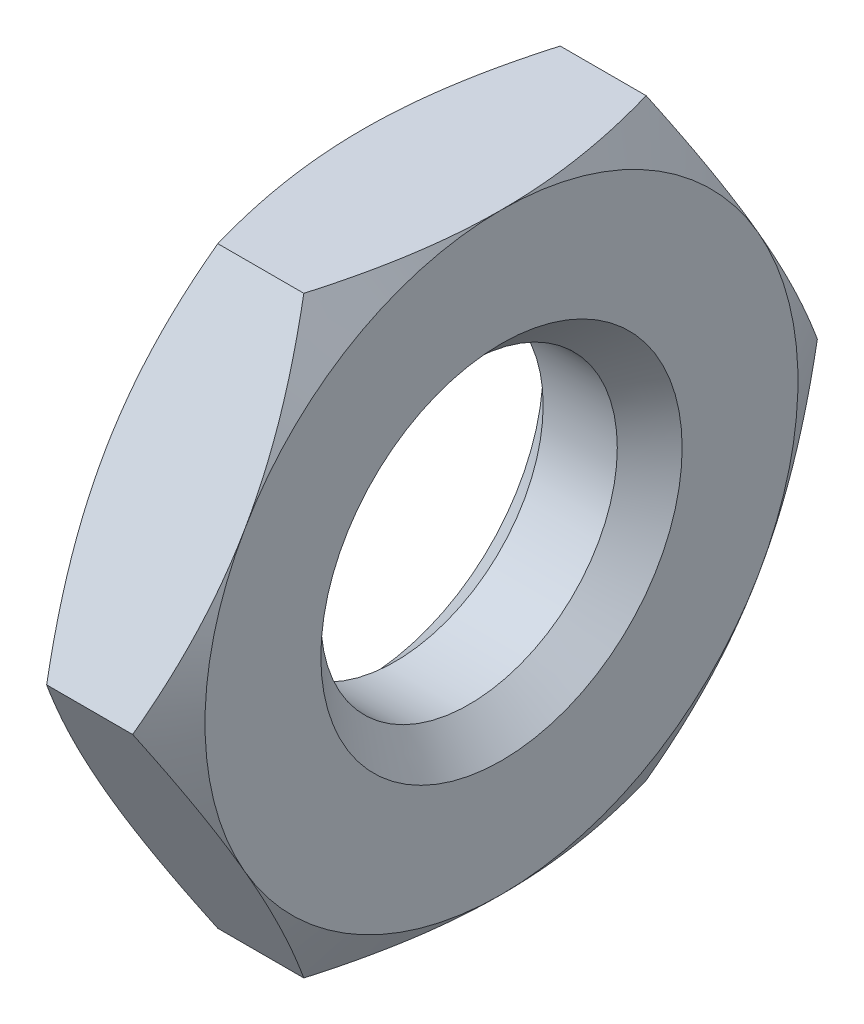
from build123d import *

# Parameters (mm, degrees)
SKETCH1_R      = 0.8
EXTRUDE1_DEPTH = 0.75
CHAMFER1_SIZE  = 0.175


with BuildPart() as part:
    # Sketch1 → Extrude1 (new body)
    with BuildSketch(Plane(origin=(0, 0, 0), x_dir=(0, 0, -1), z_dir=(1, 0, 0))):
        Polygon((0.923760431, 1.6), (-0.923760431, 1.6), (-1.847520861, 0), (-0.923760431, -1.6), (0.923760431, -1.6), (1.847520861, 0), align=None)
        Circle(SKETCH1_R, mode=Mode.SUBTRACT)
    extrude(amount=EXTRUDE1_DEPTH)

    # Sketch2 → Cut-Revolve1 (revolve, cut)
    with BuildSketch(Plane.XY):
        Polygon((0.75, 1.6), (0.75, 6.4), (0, 6.4), (0, 1.6), (0.375, 2.249519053), align=None)
    revolve(axis=Axis((0.75, 0, 0), (-1, 0, 0)), mode=Mode.SUBTRACT)

    # Chamfer1
    chamfer1_edges = [part.edges().sort_by_distance(p)[0] for p in [
        (0, 0, 0.8),
        (0.75, 0, 0.8),
    ]]
    chamfer(chamfer1_edges, length=CHAMFER1_SIZE)


solid = part.part
